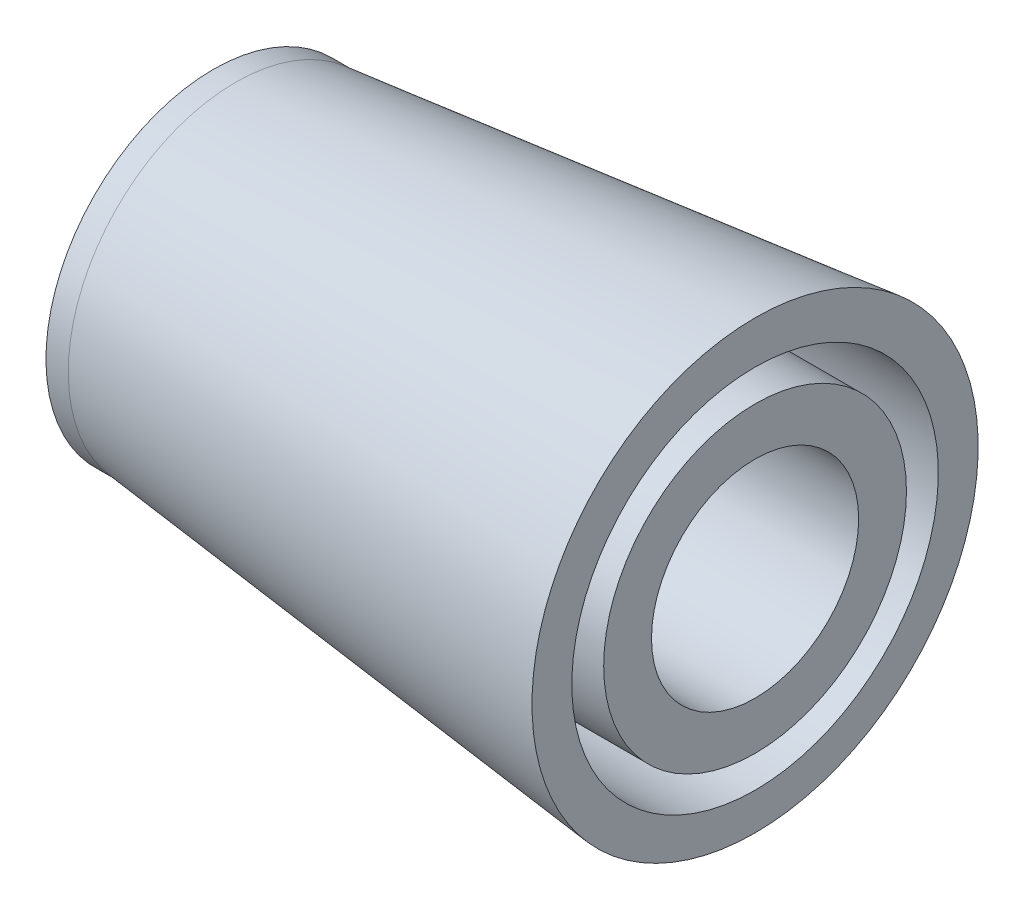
ISO-10303-21;
HEADER;
FILE_DESCRIPTION(('STEP AP214'),'2;1');
FILE_NAME('part.step','',(''),(''),'','','');
FILE_SCHEMA(('AUTOMOTIVE_DESIGN { 1 0 10303 214 1 1 1 1 }'));
ENDSEC;
DATA;
#1=APPLICATION_CONTEXT('core data for automotive mechanical design processes');
#2=APPLICATION_PROTOCOL_DEFINITION('international standard','automotive_design',2000,#1);
#3=PRODUCT_CONTEXT('',#1,'mechanical');
#4=PRODUCT('Part','Part','',(#3));
#5=PRODUCT_RELATED_PRODUCT_CATEGORY('part','',(#4));
#6=PRODUCT_DEFINITION_FORMATION('','',#4);
#7=PRODUCT_DEFINITION_CONTEXT('part definition',#1,'design');
#8=PRODUCT_DEFINITION('design','',#6,#7);
#9=PRODUCT_DEFINITION_SHAPE('','',#8);
#10=(LENGTH_UNIT() NAMED_UNIT(*) SI_UNIT(.MILLI.,.METRE.));
#11=(NAMED_UNIT(*) PLANE_ANGLE_UNIT() SI_UNIT($,.RADIAN.));
#12=(NAMED_UNIT(*) SI_UNIT($,.STERADIAN.) SOLID_ANGLE_UNIT());
#13=UNCERTAINTY_MEASURE_WITH_UNIT(LENGTH_MEASURE(1.E-05),#10,'distance_accuracy_value','');
#14=(GEOMETRIC_REPRESENTATION_CONTEXT(3) GLOBAL_UNCERTAINTY_ASSIGNED_CONTEXT((#13)) GLOBAL_UNIT_ASSIGNED_CONTEXT((#10,
#11,#12)) REPRESENTATION_CONTEXT('',''));
#15=CARTESIAN_POINT('',(0.,0.,0.));
#16=DIRECTION('',(0.,0.,1.));
#17=DIRECTION('',(1.,0.,0.));
#18=AXIS2_PLACEMENT_3D('',#15,#16,#17);
#19=CARTESIAN_POINT('',(-5.22648191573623,0.,0.));
#20=DIRECTION('',(-1.,0.,0.));
#21=DIRECTION('',(0.,-1.,0.));
#22=AXIS2_PLACEMENT_3D('',#19,#20,#21);
#23=PLANE('',#22);
#24=CARTESIAN_POINT('',(-5.22648191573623,0.,0.));
#25=DIRECTION('',(1.,0.,0.));
#26=DIRECTION('',(0.,1.,0.));
#27=AXIS2_PLACEMENT_3D('',#24,#25,#26);
#28=CIRCLE('',#27,5.25);
#29=CARTESIAN_POINT('',(-5.22648191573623,5.25,0.));
#30=VERTEX_POINT('',#29);
#31=EDGE_CURVE('E10',#30,#30,#28,.T.);
#32=ORIENTED_EDGE('',*,*,#31,.F.);
#33=EDGE_LOOP('',(#32));
#34=FACE_BOUND('',#33,.T.);
#35=ADVANCED_FACE('F34',(#34),#23,.T.);
#36=CARTESIAN_POINT('',(11.7735180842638,0.,0.));
#37=DIRECTION('',(1.,0.,0.));
#38=DIRECTION('',(0.,1.,0.));
#39=AXIS2_PLACEMENT_3D('',#36,#37,#38);
#40=CYLINDRICAL_SURFACE('',#39,5.25);
#41=ORIENTED_EDGE('',*,*,#31,.T.);
#42=EDGE_LOOP('',(#41));
#43=FACE_BOUND('',#42,.T.);
#44=CARTESIAN_POINT('',(-4.52648191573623,0.,0.));
#45=DIRECTION('',(1.,0.,0.));
#46=DIRECTION('',(0.,1.,0.));
#47=AXIS2_PLACEMENT_3D('',#44,#45,#46);
#48=CIRCLE('',#47,5.25);
#49=CARTESIAN_POINT('',(-4.52648191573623,5.25,0.));
#50=VERTEX_POINT('',#49);
#51=EDGE_CURVE('E40',#50,#50,#48,.T.);
#52=ORIENTED_EDGE('',*,*,#51,.F.);
#53=EDGE_LOOP('',(#52));
#54=FACE_BOUND('',#53,.T.);
#55=ADVANCED_FACE('F94',(#43,#54),#40,.T.);
#56=CARTESIAN_POINT('',(11.7735180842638,0.,0.));
#57=DIRECTION('',(1.,0.,0.));
#58=DIRECTION('',(0.,1.,0.));
#59=AXIS2_PLACEMENT_3D('',#56,#57,#58);
#60=CONICAL_SURFACE('',#59,7.,0.106952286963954);
#61=ORIENTED_EDGE('',*,*,#51,.T.);
#62=EDGE_LOOP('',(#61));
#63=FACE_BOUND('',#62,.T.);
#64=CARTESIAN_POINT('',(11.7735180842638,0.,0.));
#65=DIRECTION('',(1.,0.,0.));
#66=DIRECTION('',(0.,1.,0.));
#67=AXIS2_PLACEMENT_3D('',#64,#65,#66);
#68=CIRCLE('',#67,7.);
#69=CARTESIAN_POINT('',(11.7735180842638,7.,0.));
#70=VERTEX_POINT('',#69);
#71=EDGE_CURVE('E44',#70,#70,#68,.T.);
#72=ORIENTED_EDGE('',*,*,#71,.F.);
#73=EDGE_LOOP('',(#72));
#74=FACE_BOUND('',#73,.T.);
#75=ADVANCED_FACE('F88',(#63,#74),#60,.T.);
#76=CARTESIAN_POINT('',(11.7735180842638,7.,0.));
#77=DIRECTION('',(1.,0.,0.));
#78=DIRECTION('',(0.,1.,0.));
#79=AXIS2_PLACEMENT_3D('',#76,#77,#78);
#80=PLANE('',#79);
#81=CARTESIAN_POINT('',(11.7735180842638,-0.0888345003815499,0.));
#82=DIRECTION('',(1.,0.,0.));
#83=DIRECTION('',(0.,1.,0.));
#84=AXIS2_PLACEMENT_3D('',#81,#82,#83);
#85=CIRCLE('',#84,5.75);
#86=CARTESIAN_POINT('',(11.7735180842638,5.66116549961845,0.));
#87=VERTEX_POINT('',#86);
#88=EDGE_CURVE('E57',#87,#87,#85,.T.);
#89=ORIENTED_EDGE('',*,*,#88,.F.);
#90=EDGE_LOOP('',(#89));
#91=FACE_BOUND('',#90,.T.);
#92=ORIENTED_EDGE('',*,*,#71,.T.);
#93=EDGE_LOOP('',(#92));
#94=FACE_BOUND('',#93,.T.);
#95=ADVANCED_FACE('F85',(#91,#94),#80,.T.);
#96=CARTESIAN_POINT('',(6.77351808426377,-0.0888345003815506,0.));
#97=DIRECTION('',(1.,0.,0.));
#98=DIRECTION('',(0.,1.,0.));
#99=AXIS2_PLACEMENT_3D('',#96,#97,#98);
#100=CYLINDRICAL_SURFACE('',#99,4.75);
#101=CARTESIAN_POINT('',(6.77351808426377,-0.0888345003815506,0.));
#102=DIRECTION('',(1.,0.,0.));
#103=DIRECTION('',(0.,1.,0.));
#104=AXIS2_PLACEMENT_3D('',#101,#102,#103);
#105=CIRCLE('',#104,4.75);
#106=CARTESIAN_POINT('',(6.77351808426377,4.66116549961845,0.));
#107=VERTEX_POINT('',#106);
#108=EDGE_CURVE('E60',#107,#107,#105,.T.);
#109=ORIENTED_EDGE('',*,*,#108,.T.);
#110=EDGE_LOOP('',(#109));
#111=FACE_BOUND('',#110,.T.);
#112=CARTESIAN_POINT('',(11.7735180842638,-0.0888345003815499,0.));
#113=DIRECTION('',(1.,0.,0.));
#114=DIRECTION('',(0.,1.,0.));
#115=AXIS2_PLACEMENT_3D('',#112,#113,#114);
#116=CIRCLE('',#115,4.75);
#117=CARTESIAN_POINT('',(11.7735180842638,4.66116549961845,0.));
#118=VERTEX_POINT('',#117);
#119=EDGE_CURVE('E61',#118,#118,#116,.T.);
#120=ORIENTED_EDGE('',*,*,#119,.F.);
#121=EDGE_LOOP('',(#120));
#122=FACE_BOUND('',#121,.T.);
#123=ADVANCED_FACE('F69',(#111,#122),#100,.T.);
#124=CARTESIAN_POINT('',(6.77351808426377,-0.0888345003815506,0.));
#125=DIRECTION('',(1.,0.,0.));
#126=DIRECTION('',(0.,1.,0.));
#127=AXIS2_PLACEMENT_3D('',#124,#125,#126);
#128=CYLINDRICAL_SURFACE('',#127,5.75);
#129=CARTESIAN_POINT('',(6.77351808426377,-0.0888345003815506,0.));
#130=DIRECTION('',(1.,0.,0.));
#131=DIRECTION('',(0.,1.,0.));
#132=AXIS2_PLACEMENT_3D('',#129,#130,#131);
#133=CIRCLE('',#132,5.75);
#134=CARTESIAN_POINT('',(6.77351808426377,5.66116549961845,0.));
#135=VERTEX_POINT('',#134);
#136=EDGE_CURVE('E54',#135,#135,#133,.T.);
#137=ORIENTED_EDGE('',*,*,#136,.F.);
#138=EDGE_LOOP('',(#137));
#139=FACE_BOUND('',#138,.T.);
#140=ORIENTED_EDGE('',*,*,#88,.T.);
#141=EDGE_LOOP('',(#140));
#142=FACE_BOUND('',#141,.T.);
#143=ADVANCED_FACE('F76',(#139,#142),#128,.F.);
#144=CARTESIAN_POINT('',(6.77351808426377,0.,0.));
#145=DIRECTION('',(1.,0.,0.));
#146=DIRECTION('',(0.,1.,0.));
#147=AXIS2_PLACEMENT_3D('',#144,#145,#146);
#148=PLANE('',#147);
#149=ORIENTED_EDGE('',*,*,#108,.F.);
#150=EDGE_LOOP('',(#149));
#151=FACE_BOUND('',#150,.T.);
#152=ORIENTED_EDGE('',*,*,#136,.T.);
#153=EDGE_LOOP('',(#152));
#154=FACE_BOUND('',#153,.T.);
#155=ADVANCED_FACE('F72',(#151,#154),#148,.T.);
#156=CARTESIAN_POINT('',(-3.22648191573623,0.,0.));
#157=DIRECTION('',(1.,0.,0.));
#158=DIRECTION('',(0.,1.,0.));
#159=AXIS2_PLACEMENT_3D('',#156,#157,#158);
#160=PLANE('',#159);
#161=CARTESIAN_POINT('',(-3.22648191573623,-0.0888345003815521,0.));
#162=DIRECTION('',(1.,0.,0.));
#163=DIRECTION('',(0.,1.,0.));
#164=AXIS2_PLACEMENT_3D('',#161,#162,#163);
#165=CIRCLE('',#164,3.25);
#166=CARTESIAN_POINT('',(-3.22648191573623,3.16116549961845,0.));
#167=VERTEX_POINT('',#166);
#168=EDGE_CURVE('E48',#167,#167,#165,.T.);
#169=ORIENTED_EDGE('',*,*,#168,.T.);
#170=EDGE_LOOP('',(#169));
#171=FACE_BOUND('',#170,.T.);
#172=ADVANCED_FACE('F75',(#171),#160,.T.);
#173=CARTESIAN_POINT('',(-3.22648191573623,-0.0888345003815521,0.));
#174=DIRECTION('',(1.,0.,0.));
#175=DIRECTION('',(0.,1.,0.));
#176=AXIS2_PLACEMENT_3D('',#173,#174,#175);
#177=CYLINDRICAL_SURFACE('',#176,3.25);
#178=ORIENTED_EDGE('',*,*,#168,.F.);
#179=EDGE_LOOP('',(#178));
#180=FACE_BOUND('',#179,.T.);
#181=CARTESIAN_POINT('',(11.7735180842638,-0.0888345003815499,0.));
#182=DIRECTION('',(1.,0.,0.));
#183=DIRECTION('',(0.,1.,0.));
#184=AXIS2_PLACEMENT_3D('',#181,#182,#183);
#185=CIRCLE('',#184,3.25);
#186=CARTESIAN_POINT('',(11.7735180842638,3.16116549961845,0.));
#187=VERTEX_POINT('',#186);
#188=EDGE_CURVE('E51',#187,#187,#185,.T.);
#189=ORIENTED_EDGE('',*,*,#188,.T.);
#190=EDGE_LOOP('',(#189));
#191=FACE_BOUND('',#190,.T.);
#192=ADVANCED_FACE('F117',(#180,#191),#177,.F.);
#193=ORIENTED_EDGE('',*,*,#188,.F.);
#194=EDGE_LOOP('',(#193));
#195=FACE_BOUND('',#194,.T.);
#196=ORIENTED_EDGE('',*,*,#119,.T.);
#197=EDGE_LOOP('',(#196));
#198=FACE_BOUND('',#197,.T.);
#199=ADVANCED_FACE('F90',(#195,#198),#80,.T.);
#200=CLOSED_SHELL('',(#35,#55,#75,#95,#123,#143,#155,#172,#192,#199));
#201=MANIFOLD_SOLID_BREP('B2',#200);
#202=ADVANCED_BREP_SHAPE_REPRESENTATION('',(#18,#201),#14);
#203=SHAPE_DEFINITION_REPRESENTATION(#9,#202);
ENDSEC;
END-ISO-10303-21;
